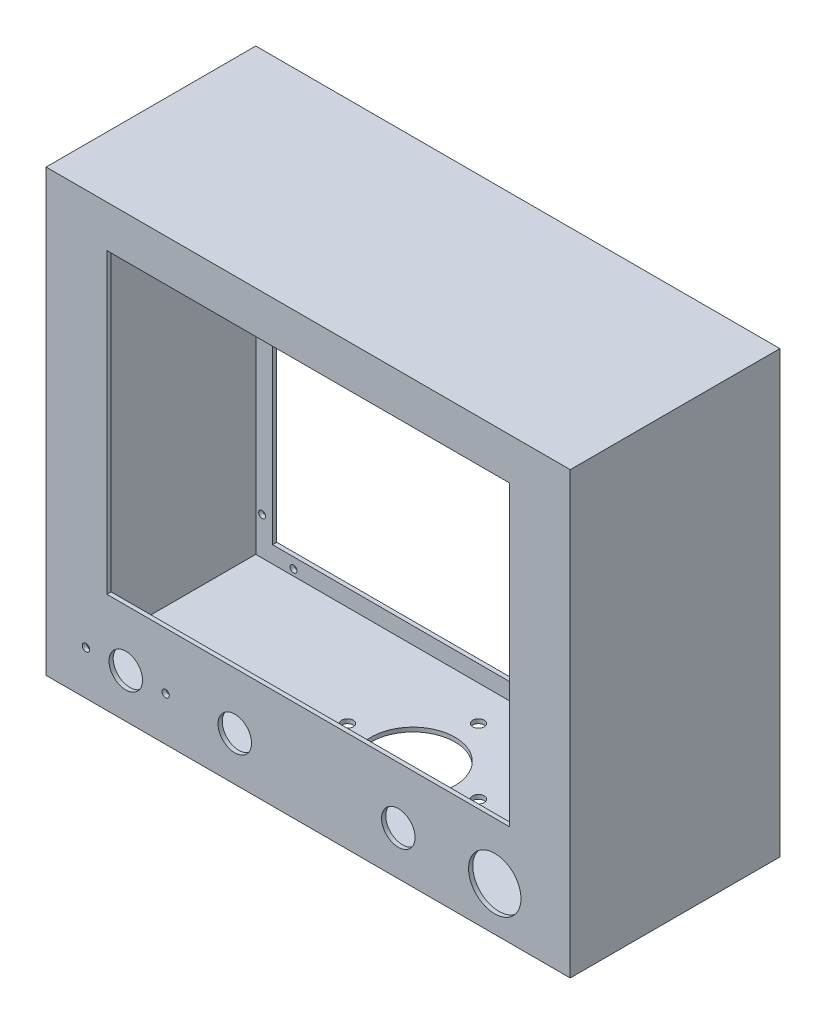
ISO-10303-21;
HEADER;
FILE_DESCRIPTION(('STEP AP214'),'2;1');
FILE_NAME('part.step','',(''),(''),'','','');
FILE_SCHEMA(('AUTOMOTIVE_DESIGN { 1 0 10303 214 1 1 1 1 }'));
ENDSEC;
DATA;
#1=APPLICATION_CONTEXT('core data for automotive mechanical design processes');
#2=APPLICATION_PROTOCOL_DEFINITION('international standard','automotive_design',2000,#1);
#3=PRODUCT_CONTEXT('',#1,'mechanical');
#4=PRODUCT('Part','Part','',(#3));
#5=PRODUCT_RELATED_PRODUCT_CATEGORY('part','',(#4));
#6=PRODUCT_DEFINITION_FORMATION('','',#4);
#7=PRODUCT_DEFINITION_CONTEXT('part definition',#1,'design');
#8=PRODUCT_DEFINITION('design','',#6,#7);
#9=PRODUCT_DEFINITION_SHAPE('','',#8);
#10=(LENGTH_UNIT() NAMED_UNIT(*) SI_UNIT(.MILLI.,.METRE.));
#11=(NAMED_UNIT(*) PLANE_ANGLE_UNIT() SI_UNIT($,.RADIAN.));
#12=(NAMED_UNIT(*) SI_UNIT($,.STERADIAN.) SOLID_ANGLE_UNIT());
#13=UNCERTAINTY_MEASURE_WITH_UNIT(LENGTH_MEASURE(1.E-05),#10,'distance_accuracy_value','');
#14=(GEOMETRIC_REPRESENTATION_CONTEXT(3) GLOBAL_UNCERTAINTY_ASSIGNED_CONTEXT((#13)) GLOBAL_UNIT_ASSIGNED_CONTEXT((#10,
#11,#12)) REPRESENTATION_CONTEXT('',''));
#15=CARTESIAN_POINT('',(0.,0.,0.));
#16=DIRECTION('',(0.,0.,1.));
#17=DIRECTION('',(1.,0.,0.));
#18=AXIS2_PLACEMENT_3D('',#15,#16,#17);
#19=CARTESIAN_POINT('',(0.,0.,100.));
#20=DIRECTION('',(1.,0.,0.));
#21=DIRECTION('',(0.,0.,-1.));
#22=AXIS2_PLACEMENT_3D('',#19,#20,#21);
#23=PLANE('',#22);
#24=DIRECTION('',(0.,-1.,0.));
#25=VECTOR('',#24,1.);
#26=CARTESIAN_POINT('',(0.,0.,0.));
#27=LINE('',#26,#25);
#28=CARTESIAN_POINT('',(0.,210.000000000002,0.));
#29=VERTEX_POINT('',#28);
#30=CARTESIAN_POINT('',(0.,0.,0.));
#31=VERTEX_POINT('',#30);
#32=EDGE_CURVE('E248',#29,#31,#27,.T.);
#33=ORIENTED_EDGE('',*,*,#32,.T.);
#34=DIRECTION('',(0.,0.,-1.));
#35=VECTOR('',#34,1.);
#36=CARTESIAN_POINT('',(0.,0.,100.));
#37=LINE('',#36,#35);
#38=CARTESIAN_POINT('',(0.,0.,100.));
#39=VERTEX_POINT('',#38);
#40=EDGE_CURVE('E281',#39,#31,#37,.T.);
#41=ORIENTED_EDGE('',*,*,#40,.F.);
#42=DIRECTION('',(0.,-1.,0.));
#43=VECTOR('',#42,1.);
#44=CARTESIAN_POINT('',(0.,0.,100.));
#45=LINE('',#44,#43);
#46=CARTESIAN_POINT('',(0.,210.000000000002,100.));
#47=VERTEX_POINT('',#46);
#48=EDGE_CURVE('E255',#47,#39,#45,.T.);
#49=ORIENTED_EDGE('',*,*,#48,.F.);
#50=DIRECTION('',(0.,0.,-1.));
#51=VECTOR('',#50,1.);
#52=CARTESIAN_POINT('',(0.,210.000000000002,100.));
#53=LINE('',#52,#51);
#54=EDGE_CURVE('E265',#47,#29,#53,.T.);
#55=ORIENTED_EDGE('',*,*,#54,.T.);
#56=EDGE_LOOP('',(#33,#41,#49,#55));
#57=FACE_BOUND('',#56,.T.);
#58=ADVANCED_FACE('F32',(#57),#23,.F.);
#59=CARTESIAN_POINT('',(0.,0.,100.));
#60=DIRECTION('',(0.,1.,0.));
#61=DIRECTION('',(0.,0.,1.));
#62=AXIS2_PLACEMENT_3D('',#59,#60,#61);
#63=PLANE('',#62);
#64=CARTESIAN_POINT('',(93.7500000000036,0.,50.));
#65=DIRECTION('',(0.,1.,0.));
#66=DIRECTION('',(0.,0.,1.));
#67=AXIS2_PLACEMENT_3D('',#64,#65,#66);
#68=CIRCLE('',#67,2.75);
#69=CARTESIAN_POINT('',(93.7500000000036,0.,52.75));
#70=VERTEX_POINT('',#69);
#71=EDGE_CURVE('E766',#70,#70,#68,.T.);
#72=ORIENTED_EDGE('',*,*,#71,.T.);
#73=EDGE_LOOP('',(#72));
#74=FACE_BOUND('',#73,.T.);
#75=CARTESIAN_POINT('',(125.000000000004,0.,18.75));
#76=DIRECTION('',(0.,1.,0.));
#77=DIRECTION('',(0.,0.,1.));
#78=AXIS2_PLACEMENT_3D('',#75,#76,#77);
#79=CIRCLE('',#78,2.75);
#80=CARTESIAN_POINT('',(125.000000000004,0.,21.5));
#81=VERTEX_POINT('',#80);
#82=EDGE_CURVE('E770',#81,#81,#79,.T.);
#83=ORIENTED_EDGE('',*,*,#82,.T.);
#84=EDGE_LOOP('',(#83));
#85=FACE_BOUND('',#84,.T.);
#86=CARTESIAN_POINT('',(156.250000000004,0.,50.));
#87=DIRECTION('',(0.,1.,0.));
#88=DIRECTION('',(0.,0.,1.));
#89=AXIS2_PLACEMENT_3D('',#86,#87,#88);
#90=CIRCLE('',#89,2.75);
#91=CARTESIAN_POINT('',(156.250000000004,0.,52.75));
#92=VERTEX_POINT('',#91);
#93=EDGE_CURVE('E774',#92,#92,#90,.T.);
#94=ORIENTED_EDGE('',*,*,#93,.T.);
#95=EDGE_LOOP('',(#94));
#96=FACE_BOUND('',#95,.T.);
#97=CARTESIAN_POINT('',(125.000000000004,0.,81.25));
#98=DIRECTION('',(0.,1.,0.));
#99=DIRECTION('',(0.,0.,1.));
#100=AXIS2_PLACEMENT_3D('',#97,#98,#99);
#101=CIRCLE('',#100,2.75);
#102=CARTESIAN_POINT('',(125.000000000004,0.,84.));
#103=VERTEX_POINT('',#102);
#104=EDGE_CURVE('E375',#103,#103,#101,.T.);
#105=ORIENTED_EDGE('',*,*,#104,.T.);
#106=EDGE_LOOP('',(#105));
#107=FACE_BOUND('',#106,.T.);
#108=CARTESIAN_POINT('',(125.000000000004,0.,50.));
#109=DIRECTION('',(0.,1.,0.));
#110=DIRECTION('',(0.,0.,1.));
#111=AXIS2_PLACEMENT_3D('',#108,#109,#110);
#112=CIRCLE('',#111,20.);
#113=CARTESIAN_POINT('',(125.000000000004,0.,70.));
#114=VERTEX_POINT('',#113);
#115=EDGE_CURVE('E374',#114,#114,#112,.T.);
#116=ORIENTED_EDGE('',*,*,#115,.T.);
#117=EDGE_LOOP('',(#116));
#118=FACE_BOUND('',#117,.T.);
#119=DIRECTION('',(1.,0.,0.));
#120=VECTOR('',#119,1.);
#121=CARTESIAN_POINT('',(0.,0.,0.));
#122=LINE('',#121,#120);
#123=CARTESIAN_POINT('',(250.000000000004,0.,0.));
#124=VERTEX_POINT('',#123);
#125=EDGE_CURVE('E268',#31,#124,#122,.T.);
#126=ORIENTED_EDGE('',*,*,#125,.T.);
#127=DIRECTION('',(0.,0.,-1.));
#128=VECTOR('',#127,1.);
#129=CARTESIAN_POINT('',(250.000000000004,0.,100.));
#130=LINE('',#129,#128);
#131=CARTESIAN_POINT('',(250.000000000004,0.,100.));
#132=VERTEX_POINT('',#131);
#133=EDGE_CURVE('E278',#132,#124,#130,.T.);
#134=ORIENTED_EDGE('',*,*,#133,.F.);
#135=DIRECTION('',(1.,0.,0.));
#136=VECTOR('',#135,1.);
#137=CARTESIAN_POINT('',(0.,0.,100.));
#138=LINE('',#137,#136);
#139=EDGE_CURVE('E258',#39,#132,#138,.T.);
#140=ORIENTED_EDGE('',*,*,#139,.F.);
#141=ORIENTED_EDGE('',*,*,#40,.T.);
#142=EDGE_LOOP('',(#126,#134,#140,#141));
#143=FACE_BOUND('',#142,.T.);
#144=ADVANCED_FACE('F336',(#74,#85,#96,#107,#118,#143),#63,.F.);
#145=CARTESIAN_POINT('',(250.000000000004,0.,100.));
#146=DIRECTION('',(-1.,0.,0.));
#147=DIRECTION('',(0.,0.,1.));
#148=AXIS2_PLACEMENT_3D('',#145,#146,#147);
#149=PLANE('',#148);
#150=DIRECTION('',(0.,1.,0.));
#151=VECTOR('',#150,1.);
#152=CARTESIAN_POINT('',(250.000000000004,0.,0.));
#153=LINE('',#152,#151);
#154=CARTESIAN_POINT('',(250.000000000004,210.000000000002,0.));
#155=VERTEX_POINT('',#154);
#156=EDGE_CURVE('E270',#124,#155,#153,.T.);
#157=ORIENTED_EDGE('',*,*,#156,.T.);
#158=DIRECTION('',(0.,0.,-1.));
#159=VECTOR('',#158,1.);
#160=CARTESIAN_POINT('',(250.000000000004,210.000000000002,100.));
#161=LINE('',#160,#159);
#162=CARTESIAN_POINT('',(250.000000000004,210.000000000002,100.));
#163=VERTEX_POINT('',#162);
#164=EDGE_CURVE('E275',#163,#155,#161,.T.);
#165=ORIENTED_EDGE('',*,*,#164,.F.);
#166=DIRECTION('',(0.,1.,0.));
#167=VECTOR('',#166,1.);
#168=CARTESIAN_POINT('',(250.000000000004,0.,100.));
#169=LINE('',#168,#167);
#170=EDGE_CURVE('E261',#132,#163,#169,.T.);
#171=ORIENTED_EDGE('',*,*,#170,.F.);
#172=ORIENTED_EDGE('',*,*,#133,.T.);
#173=EDGE_LOOP('',(#157,#165,#171,#172));
#174=FACE_BOUND('',#173,.T.);
#175=ADVANCED_FACE('F342',(#174),#149,.F.);
#176=CARTESIAN_POINT('',(0.,210.000000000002,100.));
#177=DIRECTION('',(0.,-1.,0.));
#178=DIRECTION('',(0.,0.,-1.));
#179=AXIS2_PLACEMENT_3D('',#176,#177,#178);
#180=PLANE('',#179);
#181=DIRECTION('',(-1.,0.,0.));
#182=VECTOR('',#181,1.);
#183=CARTESIAN_POINT('',(0.,210.000000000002,0.));
#184=LINE('',#183,#182);
#185=EDGE_CURVE('E259',#155,#29,#184,.T.);
#186=ORIENTED_EDGE('',*,*,#185,.T.);
#187=ORIENTED_EDGE('',*,*,#54,.F.);
#188=DIRECTION('',(-1.,0.,0.));
#189=VECTOR('',#188,1.);
#190=CARTESIAN_POINT('',(0.,210.000000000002,100.));
#191=LINE('',#190,#189);
#192=EDGE_CURVE('E263',#163,#47,#191,.T.);
#193=ORIENTED_EDGE('',*,*,#192,.F.);
#194=ORIENTED_EDGE('',*,*,#164,.T.);
#195=EDGE_LOOP('',(#186,#187,#193,#194));
#196=FACE_BOUND('',#195,.T.);
#197=ADVANCED_FACE('F495',(#196),#180,.F.);
#198=CARTESIAN_POINT('',(0.,210.000000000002,100.));
#199=DIRECTION('',(0.,0.,-1.));
#200=DIRECTION('',(-1.,0.,0.));
#201=AXIS2_PLACEMENT_3D('',#198,#199,#200);
#202=PLANE('',#201);
#203=CARTESIAN_POINT('',(214.,21.0000000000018,100.));
#204=DIRECTION('',(0.,0.,1.));
#205=DIRECTION('',(1.,0.,0.));
#206=AXIS2_PLACEMENT_3D('',#203,#204,#205);
#207=CIRCLE('',#206,12.5);
#208=CARTESIAN_POINT('',(226.5,21.0000000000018,100.));
#209=VERTEX_POINT('',#208);
#210=EDGE_CURVE('E183',#209,#209,#207,.T.);
#211=ORIENTED_EDGE('',*,*,#210,.F.);
#212=EDGE_LOOP('',(#211));
#213=FACE_BOUND('',#212,.T.);
#214=CARTESIAN_POINT('',(38.0000000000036,21.0000000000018,100.));
#215=DIRECTION('',(0.,0.,1.));
#216=DIRECTION('',(1.,0.,0.));
#217=AXIS2_PLACEMENT_3D('',#214,#215,#216);
#218=CIRCLE('',#217,8.);
#219=CARTESIAN_POINT('',(46.0000000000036,21.0000000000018,100.));
#220=VERTEX_POINT('',#219);
#221=EDGE_CURVE('E190',#220,#220,#218,.T.);
#222=ORIENTED_EDGE('',*,*,#221,.F.);
#223=EDGE_LOOP('',(#222));
#224=FACE_BOUND('',#223,.T.);
#225=CARTESIAN_POINT('',(168.000000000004,21.0000000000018,100.));
#226=DIRECTION('',(0.,0.,1.));
#227=DIRECTION('',(1.,0.,0.));
#228=AXIS2_PLACEMENT_3D('',#225,#226,#227);
#229=CIRCLE('',#228,8.00000000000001);
#230=CARTESIAN_POINT('',(176.000000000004,21.0000000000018,100.));
#231=VERTEX_POINT('',#230);
#232=EDGE_CURVE('E196',#231,#231,#229,.T.);
#233=ORIENTED_EDGE('',*,*,#232,.F.);
#234=EDGE_LOOP('',(#233));
#235=FACE_BOUND('',#234,.T.);
#236=CARTESIAN_POINT('',(90.,21.0000000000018,100.));
#237=DIRECTION('',(0.,0.,1.));
#238=DIRECTION('',(1.,0.,0.));
#239=AXIS2_PLACEMENT_3D('',#236,#237,#238);
#240=CIRCLE('',#239,8.00000000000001);
#241=CARTESIAN_POINT('',(98.,21.0000000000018,100.));
#242=VERTEX_POINT('',#241);
#243=EDGE_CURVE('E202',#242,#242,#240,.T.);
#244=ORIENTED_EDGE('',*,*,#243,.F.);
#245=EDGE_LOOP('',(#244));
#246=FACE_BOUND('',#245,.T.);
#247=CARTESIAN_POINT('',(57.0000000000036,21.0000000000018,100.));
#248=DIRECTION('',(0.,0.,1.));
#249=DIRECTION('',(1.,0.,0.));
#250=AXIS2_PLACEMENT_3D('',#247,#248,#249);
#251=CIRCLE('',#250,1.75);
#252=CARTESIAN_POINT('',(58.7500000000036,21.0000000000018,100.));
#253=VERTEX_POINT('',#252);
#254=EDGE_CURVE('E208',#253,#253,#251,.T.);
#255=ORIENTED_EDGE('',*,*,#254,.F.);
#256=EDGE_LOOP('',(#255));
#257=FACE_BOUND('',#256,.T.);
#258=CARTESIAN_POINT('',(19.0000000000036,21.0000000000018,100.));
#259=DIRECTION('',(0.,0.,1.));
#260=DIRECTION('',(1.,0.,0.));
#261=AXIS2_PLACEMENT_3D('',#258,#259,#260);
#262=CIRCLE('',#261,1.75);
#263=CARTESIAN_POINT('',(20.7500000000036,21.0000000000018,100.));
#264=VERTEX_POINT('',#263);
#265=EDGE_CURVE('E214',#264,#264,#262,.T.);
#266=ORIENTED_EDGE('',*,*,#265,.F.);
#267=EDGE_LOOP('',(#266));
#268=FACE_BOUND('',#267,.T.);
#269=DIRECTION('',(1.,0.,0.));
#270=VECTOR('',#269,1.);
#271=CARTESIAN_POINT('',(29.,48.,100.));
#272=LINE('',#271,#270);
#273=CARTESIAN_POINT('',(29.,48.,100.));
#274=VERTEX_POINT('',#273);
#275=CARTESIAN_POINT('',(221.,48.,100.));
#276=VERTEX_POINT('',#275);
#277=EDGE_CURVE('E238',#274,#276,#272,.T.);
#278=ORIENTED_EDGE('',*,*,#277,.F.);
#279=DIRECTION('',(0.,-1.,0.));
#280=VECTOR('',#279,1.);
#281=CARTESIAN_POINT('',(29.,48.,100.));
#282=LINE('',#281,#280);
#283=CARTESIAN_POINT('',(29.,190.000000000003,100.));
#284=VERTEX_POINT('',#283);
#285=EDGE_CURVE('E220',#284,#274,#282,.T.);
#286=ORIENTED_EDGE('',*,*,#285,.F.);
#287=DIRECTION('',(-1.,0.,0.));
#288=VECTOR('',#287,1.);
#289=CARTESIAN_POINT('',(29.,190.000000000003,100.));
#290=LINE('',#289,#288);
#291=CARTESIAN_POINT('',(221.,190.000000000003,100.));
#292=VERTEX_POINT('',#291);
#293=EDGE_CURVE('E227',#292,#284,#290,.T.);
#294=ORIENTED_EDGE('',*,*,#293,.F.);
#295=DIRECTION('',(0.,1.,0.));
#296=VECTOR('',#295,1.);
#297=CARTESIAN_POINT('',(221.,48.,100.));
#298=LINE('',#297,#296);
#299=EDGE_CURVE('E241',#276,#292,#298,.T.);
#300=ORIENTED_EDGE('',*,*,#299,.F.);
#301=EDGE_LOOP('',(#278,#286,#294,#300));
#302=FACE_BOUND('',#301,.T.);
#303=ORIENTED_EDGE('',*,*,#48,.T.);
#304=ORIENTED_EDGE('',*,*,#139,.T.);
#305=ORIENTED_EDGE('',*,*,#170,.T.);
#306=ORIENTED_EDGE('',*,*,#192,.T.);
#307=EDGE_LOOP('',(#303,#304,#305,#306));
#308=FACE_BOUND('',#307,.T.);
#309=ADVANCED_FACE('F492',(#213,#224,#235,#246,#257,#268,#302,#308),#202,.F.);
#310=CARTESIAN_POINT('',(0.,210.000000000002,0.));
#311=DIRECTION('',(0.,0.,-1.));
#312=DIRECTION('',(-1.,0.,0.));
#313=AXIS2_PLACEMENT_3D('',#310,#311,#312);
#314=PLANE('',#313);
#315=CARTESIAN_POINT('',(5.,190.000000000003,0.));
#316=DIRECTION('',(0.,0.,1.));
#317=DIRECTION('',(1.,0.,0.));
#318=AXIS2_PLACEMENT_3D('',#315,#316,#317);
#319=CIRCLE('',#318,1.65);
#320=CARTESIAN_POINT('',(6.65,190.000000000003,0.));
#321=VERTEX_POINT('',#320);
#322=EDGE_CURVE('E384',#321,#321,#319,.T.);
#323=ORIENTED_EDGE('',*,*,#322,.T.);
#324=EDGE_LOOP('',(#323));
#325=FACE_BOUND('',#324,.T.);
#326=CARTESIAN_POINT('',(5.,20.0000000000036,0.));
#327=DIRECTION('',(0.,0.,1.));
#328=DIRECTION('',(1.,0.,0.));
#329=AXIS2_PLACEMENT_3D('',#326,#327,#328);
#330=CIRCLE('',#329,1.65);
#331=CARTESIAN_POINT('',(6.65,20.0000000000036,0.));
#332=VERTEX_POINT('',#331);
#333=EDGE_CURVE('E390',#332,#332,#330,.T.);
#334=ORIENTED_EDGE('',*,*,#333,.T.);
#335=EDGE_LOOP('',(#334));
#336=FACE_BOUND('',#335,.T.);
#337=CARTESIAN_POINT('',(20.,5.00000000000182,0.));
#338=DIRECTION('',(0.,0.,1.));
#339=DIRECTION('',(1.,0.,0.));
#340=AXIS2_PLACEMENT_3D('',#337,#338,#339);
#341=CIRCLE('',#340,1.65);
#342=CARTESIAN_POINT('',(21.65,5.00000000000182,0.));
#343=VERTEX_POINT('',#342);
#344=EDGE_CURVE('E396',#343,#343,#341,.T.);
#345=ORIENTED_EDGE('',*,*,#344,.T.);
#346=EDGE_LOOP('',(#345));
#347=FACE_BOUND('',#346,.T.);
#348=CARTESIAN_POINT('',(230.000000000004,5.00000000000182,0.));
#349=DIRECTION('',(0.,0.,1.));
#350=DIRECTION('',(1.,0.,0.));
#351=AXIS2_PLACEMENT_3D('',#348,#349,#350);
#352=CIRCLE('',#351,1.65000000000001);
#353=CARTESIAN_POINT('',(231.650000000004,5.00000000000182,0.));
#354=VERTEX_POINT('',#353);
#355=EDGE_CURVE('E402',#354,#354,#352,.T.);
#356=ORIENTED_EDGE('',*,*,#355,.T.);
#357=EDGE_LOOP('',(#356));
#358=FACE_BOUND('',#357,.T.);
#359=CARTESIAN_POINT('',(245.000000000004,20.0000000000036,0.));
#360=DIRECTION('',(0.,0.,1.));
#361=DIRECTION('',(1.,0.,0.));
#362=AXIS2_PLACEMENT_3D('',#359,#360,#361);
#363=CIRCLE('',#362,1.65000000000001);
#364=CARTESIAN_POINT('',(246.650000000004,20.0000000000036,0.));
#365=VERTEX_POINT('',#364);
#366=EDGE_CURVE('E408',#365,#365,#363,.T.);
#367=ORIENTED_EDGE('',*,*,#366,.T.);
#368=EDGE_LOOP('',(#367));
#369=FACE_BOUND('',#368,.T.);
#370=CARTESIAN_POINT('',(245.000000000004,190.000000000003,0.));
#371=DIRECTION('',(0.,0.,1.));
#372=DIRECTION('',(1.,0.,0.));
#373=AXIS2_PLACEMENT_3D('',#370,#371,#372);
#374=CIRCLE('',#373,1.65000000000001);
#375=CARTESIAN_POINT('',(246.650000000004,190.000000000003,0.));
#376=VERTEX_POINT('',#375);
#377=EDGE_CURVE('E414',#376,#376,#374,.T.);
#378=ORIENTED_EDGE('',*,*,#377,.T.);
#379=EDGE_LOOP('',(#378));
#380=FACE_BOUND('',#379,.T.);
#381=CARTESIAN_POINT('',(230.000000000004,205.000000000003,0.));
#382=DIRECTION('',(0.,0.,1.));
#383=DIRECTION('',(1.,0.,0.));
#384=AXIS2_PLACEMENT_3D('',#381,#382,#383);
#385=CIRCLE('',#384,1.65000000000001);
#386=CARTESIAN_POINT('',(231.650000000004,205.000000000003,0.));
#387=VERTEX_POINT('',#386);
#388=EDGE_CURVE('E420',#387,#387,#385,.T.);
#389=ORIENTED_EDGE('',*,*,#388,.T.);
#390=EDGE_LOOP('',(#389));
#391=FACE_BOUND('',#390,.T.);
#392=CARTESIAN_POINT('',(20.,205.000000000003,0.));
#393=DIRECTION('',(0.,0.,1.));
#394=DIRECTION('',(1.,0.,0.));
#395=AXIS2_PLACEMENT_3D('',#392,#393,#394);
#396=CIRCLE('',#395,1.65);
#397=CARTESIAN_POINT('',(21.65,205.000000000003,0.));
#398=VERTEX_POINT('',#397);
#399=EDGE_CURVE('E177',#398,#398,#396,.T.);
#400=ORIENTED_EDGE('',*,*,#399,.T.);
#401=EDGE_LOOP('',(#400));
#402=FACE_BOUND('',#401,.T.);
#403=DIRECTION('',(1.,0.,0.));
#404=VECTOR('',#403,1.);
#405=CARTESIAN_POINT('',(10.0000000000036,10.0000000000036,0.));
#406=LINE('',#405,#404);
#407=CARTESIAN_POINT('',(10.0000000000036,10.0000000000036,0.));
#408=VERTEX_POINT('',#407);
#409=CARTESIAN_POINT('',(240.000000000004,10.0000000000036,0.));
#410=VERTEX_POINT('',#409);
#411=EDGE_CURVE('E148',#408,#410,#406,.T.);
#412=ORIENTED_EDGE('',*,*,#411,.T.);
#413=DIRECTION('',(0.,1.,0.));
#414=VECTOR('',#413,1.);
#415=CARTESIAN_POINT('',(240.000000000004,10.0000000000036,0.));
#416=LINE('',#415,#414);
#417=CARTESIAN_POINT('',(240.000000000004,200.000000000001,0.));
#418=VERTEX_POINT('',#417);
#419=EDGE_CURVE('E157',#410,#418,#416,.T.);
#420=ORIENTED_EDGE('',*,*,#419,.T.);
#421=DIRECTION('',(-1.,0.,0.));
#422=VECTOR('',#421,1.);
#423=CARTESIAN_POINT('',(10.0000000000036,200.000000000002,0.));
#424=LINE('',#423,#422);
#425=CARTESIAN_POINT('',(10.0000000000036,200.000000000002,0.));
#426=VERTEX_POINT('',#425);
#427=EDGE_CURVE('E49',#418,#426,#424,.T.);
#428=ORIENTED_EDGE('',*,*,#427,.T.);
#429=DIRECTION('',(0.,-1.,0.));
#430=VECTOR('',#429,1.);
#431=CARTESIAN_POINT('',(10.0000000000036,10.0000000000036,0.));
#432=LINE('',#431,#430);
#433=EDGE_CURVE('E154',#426,#408,#432,.T.);
#434=ORIENTED_EDGE('',*,*,#433,.T.);
#435=EDGE_LOOP('',(#412,#420,#428,#434));
#436=FACE_BOUND('',#435,.T.);
#437=ORIENTED_EDGE('',*,*,#32,.F.);
#438=ORIENTED_EDGE('',*,*,#185,.F.);
#439=ORIENTED_EDGE('',*,*,#156,.F.);
#440=ORIENTED_EDGE('',*,*,#125,.F.);
#441=EDGE_LOOP('',(#437,#438,#439,#440));
#442=FACE_BOUND('',#441,.T.);
#443=ADVANCED_FACE('F161',(#325,#336,#347,#358,#369,#380,#391,#402,#436,#442),#314,.T.);
#444=CARTESIAN_POINT('',(29.,48.,98.));
#445=DIRECTION('',(-1.,0.,0.));
#446=DIRECTION('',(0.,0.,1.));
#447=AXIS2_PLACEMENT_3D('',#444,#445,#446);
#448=PLANE('',#447);
#449=ORIENTED_EDGE('',*,*,#285,.T.);
#450=DIRECTION('',(0.,0.,1.));
#451=VECTOR('',#450,1.);
#452=CARTESIAN_POINT('',(29.,48.,98.));
#453=LINE('',#452,#451);
#454=CARTESIAN_POINT('',(29.,48.,98.));
#455=VERTEX_POINT('',#454);
#456=EDGE_CURVE('E236',#455,#274,#453,.T.);
#457=ORIENTED_EDGE('',*,*,#456,.F.);
#458=DIRECTION('',(0.,-1.,0.));
#459=VECTOR('',#458,1.);
#460=CARTESIAN_POINT('',(29.,48.,98.));
#461=LINE('',#460,#459);
#462=CARTESIAN_POINT('',(29.,190.000000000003,98.));
#463=VERTEX_POINT('',#462);
#464=EDGE_CURVE('E223',#463,#455,#461,.T.);
#465=ORIENTED_EDGE('',*,*,#464,.F.);
#466=DIRECTION('',(0.,0.,1.));
#467=VECTOR('',#466,1.);
#468=CARTESIAN_POINT('',(29.,190.000000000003,98.));
#469=LINE('',#468,#467);
#470=EDGE_CURVE('E246',#463,#284,#469,.T.);
#471=ORIENTED_EDGE('',*,*,#470,.T.);
#472=EDGE_LOOP('',(#449,#457,#465,#471));
#473=FACE_BOUND('',#472,.T.);
#474=ADVANCED_FACE('F481',(#473),#448,.F.);
#475=CARTESIAN_POINT('',(29.,190.000000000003,98.));
#476=DIRECTION('',(0.,1.,0.));
#477=DIRECTION('',(0.,0.,1.));
#478=AXIS2_PLACEMENT_3D('',#475,#476,#477);
#479=PLANE('',#478);
#480=ORIENTED_EDGE('',*,*,#293,.T.);
#481=ORIENTED_EDGE('',*,*,#470,.F.);
#482=DIRECTION('',(-1.,0.,0.));
#483=VECTOR('',#482,1.);
#484=CARTESIAN_POINT('',(29.,190.000000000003,98.));
#485=LINE('',#484,#483);
#486=CARTESIAN_POINT('',(221.,190.000000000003,98.));
#487=VERTEX_POINT('',#486);
#488=EDGE_CURVE('E233',#487,#463,#485,.T.);
#489=ORIENTED_EDGE('',*,*,#488,.F.);
#490=DIRECTION('',(0.,0.,1.));
#491=VECTOR('',#490,1.);
#492=CARTESIAN_POINT('',(221.,190.000000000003,98.));
#493=LINE('',#492,#491);
#494=EDGE_CURVE('E249',#487,#292,#493,.T.);
#495=ORIENTED_EDGE('',*,*,#494,.T.);
#496=EDGE_LOOP('',(#480,#481,#489,#495));
#497=FACE_BOUND('',#496,.T.);
#498=ADVANCED_FACE('F477',(#497),#479,.F.);
#499=CARTESIAN_POINT('',(221.,48.,98.));
#500=DIRECTION('',(1.,0.,0.));
#501=DIRECTION('',(0.,0.,-1.));
#502=AXIS2_PLACEMENT_3D('',#499,#500,#501);
#503=PLANE('',#502);
#504=ORIENTED_EDGE('',*,*,#299,.T.);
#505=ORIENTED_EDGE('',*,*,#494,.F.);
#506=DIRECTION('',(0.,1.,0.));
#507=VECTOR('',#506,1.);
#508=CARTESIAN_POINT('',(221.,48.,98.));
#509=LINE('',#508,#507);
#510=CARTESIAN_POINT('',(221.,48.,98.));
#511=VERTEX_POINT('',#510);
#512=EDGE_CURVE('E230',#511,#487,#509,.T.);
#513=ORIENTED_EDGE('',*,*,#512,.F.);
#514=DIRECTION('',(0.,0.,1.));
#515=VECTOR('',#514,1.);
#516=CARTESIAN_POINT('',(221.,48.,98.));
#517=LINE('',#516,#515);
#518=EDGE_CURVE('E251',#511,#276,#517,.T.);
#519=ORIENTED_EDGE('',*,*,#518,.T.);
#520=EDGE_LOOP('',(#504,#505,#513,#519));
#521=FACE_BOUND('',#520,.T.);
#522=ADVANCED_FACE('F480',(#521),#503,.F.);
#523=CARTESIAN_POINT('',(29.,48.,98.));
#524=DIRECTION('',(0.,-1.,0.));
#525=DIRECTION('',(0.,0.,-1.));
#526=AXIS2_PLACEMENT_3D('',#523,#524,#525);
#527=PLANE('',#526);
#528=ORIENTED_EDGE('',*,*,#277,.T.);
#529=ORIENTED_EDGE('',*,*,#518,.F.);
#530=DIRECTION('',(1.,0.,0.));
#531=VECTOR('',#530,1.);
#532=CARTESIAN_POINT('',(29.,48.,98.));
#533=LINE('',#532,#531);
#534=EDGE_CURVE('E226',#455,#511,#533,.T.);
#535=ORIENTED_EDGE('',*,*,#534,.F.);
#536=ORIENTED_EDGE('',*,*,#456,.T.);
#537=EDGE_LOOP('',(#528,#529,#535,#536));
#538=FACE_BOUND('',#537,.T.);
#539=ADVANCED_FACE('F349',(#538),#527,.F.);
#540=CARTESIAN_POINT('',(2.,0.,100.));
#541=DIRECTION('',(1.,0.,0.));
#542=DIRECTION('',(0.,0.,-1.));
#543=AXIS2_PLACEMENT_3D('',#540,#541,#542);
#544=PLANE('',#543);
#545=DIRECTION('',(0.,-1.,0.));
#546=VECTOR('',#545,1.);
#547=CARTESIAN_POINT('',(2.,210.000000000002,2.));
#548=LINE('',#547,#546);
#549=CARTESIAN_POINT('',(2.,208.000000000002,2.));
#550=VERTEX_POINT('',#549);
#551=CARTESIAN_POINT('',(2.,2.,2.));
#552=VERTEX_POINT('',#551);
#553=EDGE_CURVE('E36',#550,#552,#548,.T.);
#554=ORIENTED_EDGE('',*,*,#553,.F.);
#555=DIRECTION('',(0.,0.,-1.));
#556=VECTOR('',#555,1.);
#557=CARTESIAN_POINT('',(2.,208.000000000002,100.));
#558=LINE('',#557,#556);
#559=CARTESIAN_POINT('',(2.,208.000000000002,98.));
#560=VERTEX_POINT('',#559);
#561=EDGE_CURVE('E304',#560,#550,#558,.T.);
#562=ORIENTED_EDGE('',*,*,#561,.F.);
#563=DIRECTION('',(0.,-1.,0.));
#564=VECTOR('',#563,1.);
#565=CARTESIAN_POINT('',(2.,210.000000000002,98.));
#566=LINE('',#565,#564);
#567=CARTESIAN_POINT('',(2.,2.,98.));
#568=VERTEX_POINT('',#567);
#569=EDGE_CURVE('E287',#560,#568,#566,.T.);
#570=ORIENTED_EDGE('',*,*,#569,.T.);
#571=DIRECTION('',(0.,0.,-1.));
#572=VECTOR('',#571,1.);
#573=CARTESIAN_POINT('',(2.,2.,100.));
#574=LINE('',#573,#572);
#575=EDGE_CURVE('E300',#568,#552,#574,.T.);
#576=ORIENTED_EDGE('',*,*,#575,.T.);
#577=EDGE_LOOP('',(#554,#562,#570,#576));
#578=FACE_BOUND('',#577,.T.);
#579=ADVANCED_FACE('F313',(#578),#544,.T.);
#580=CARTESIAN_POINT('',(0.,2.,100.));
#581=DIRECTION('',(0.,1.,0.));
#582=DIRECTION('',(0.,0.,1.));
#583=AXIS2_PLACEMENT_3D('',#580,#581,#582);
#584=PLANE('',#583);
#585=CARTESIAN_POINT('',(93.7500000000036,2.,50.));
#586=DIRECTION('',(0.,1.,0.));
#587=DIRECTION('',(0.,0.,1.));
#588=AXIS2_PLACEMENT_3D('',#585,#586,#587);
#589=CIRCLE('',#588,2.75);
#590=CARTESIAN_POINT('',(93.7500000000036,2.,52.75));
#591=VERTEX_POINT('',#590);
#592=EDGE_CURVE('E357',#591,#591,#589,.T.);
#593=ORIENTED_EDGE('',*,*,#592,.F.);
#594=EDGE_LOOP('',(#593));
#595=FACE_BOUND('',#594,.T.);
#596=CARTESIAN_POINT('',(125.000000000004,2.,18.75));
#597=DIRECTION('',(0.,1.,0.));
#598=DIRECTION('',(0.,0.,1.));
#599=AXIS2_PLACEMENT_3D('',#596,#597,#598);
#600=CIRCLE('',#599,2.75);
#601=CARTESIAN_POINT('',(125.000000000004,2.,21.5));
#602=VERTEX_POINT('',#601);
#603=EDGE_CURVE('E361',#602,#602,#600,.T.);
#604=ORIENTED_EDGE('',*,*,#603,.F.);
#605=EDGE_LOOP('',(#604));
#606=FACE_BOUND('',#605,.T.);
#607=CARTESIAN_POINT('',(156.250000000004,2.,50.));
#608=DIRECTION('',(0.,1.,0.));
#609=DIRECTION('',(0.,0.,1.));
#610=AXIS2_PLACEMENT_3D('',#607,#608,#609);
#611=CIRCLE('',#610,2.75);
#612=CARTESIAN_POINT('',(156.250000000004,2.,52.75));
#613=VERTEX_POINT('',#612);
#614=EDGE_CURVE('E365',#613,#613,#611,.T.);
#615=ORIENTED_EDGE('',*,*,#614,.F.);
#616=EDGE_LOOP('',(#615));
#617=FACE_BOUND('',#616,.T.);
#618=CARTESIAN_POINT('',(125.000000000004,2.,81.25));
#619=DIRECTION('',(0.,1.,0.));
#620=DIRECTION('',(0.,0.,1.));
#621=AXIS2_PLACEMENT_3D('',#618,#619,#620);
#622=CIRCLE('',#621,2.75);
#623=CARTESIAN_POINT('',(125.000000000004,2.,84.));
#624=VERTEX_POINT('',#623);
#625=EDGE_CURVE('E369',#624,#624,#622,.T.);
#626=ORIENTED_EDGE('',*,*,#625,.F.);
#627=EDGE_LOOP('',(#626));
#628=FACE_BOUND('',#627,.T.);
#629=CARTESIAN_POINT('',(125.000000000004,2.,50.));
#630=DIRECTION('',(0.,1.,0.));
#631=DIRECTION('',(0.,0.,1.));
#632=AXIS2_PLACEMENT_3D('',#629,#630,#631);
#633=CIRCLE('',#632,20.);
#634=CARTESIAN_POINT('',(125.000000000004,2.,70.));
#635=VERTEX_POINT('',#634);
#636=EDGE_CURVE('E372',#635,#635,#633,.T.);
#637=ORIENTED_EDGE('',*,*,#636,.F.);
#638=EDGE_LOOP('',(#637));
#639=FACE_BOUND('',#638,.T.);
#640=DIRECTION('',(1.,0.,0.));
#641=VECTOR('',#640,1.);
#642=CARTESIAN_POINT('',(0.,2.,2.));
#643=LINE('',#642,#641);
#644=CARTESIAN_POINT('',(248.000000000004,2.,2.));
#645=VERTEX_POINT('',#644);
#646=EDGE_CURVE('E303',#552,#645,#643,.T.);
#647=ORIENTED_EDGE('',*,*,#646,.F.);
#648=ORIENTED_EDGE('',*,*,#575,.F.);
#649=DIRECTION('',(1.,0.,0.));
#650=VECTOR('',#649,1.);
#651=CARTESIAN_POINT('',(0.,2.,98.));
#652=LINE('',#651,#650);
#653=CARTESIAN_POINT('',(248.000000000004,2.,98.));
#654=VERTEX_POINT('',#653);
#655=EDGE_CURVE('E285',#568,#654,#652,.T.);
#656=ORIENTED_EDGE('',*,*,#655,.T.);
#657=DIRECTION('',(0.,0.,-1.));
#658=VECTOR('',#657,1.);
#659=CARTESIAN_POINT('',(248.000000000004,2.,100.));
#660=LINE('',#659,#658);
#661=EDGE_CURVE('E295',#654,#645,#660,.T.);
#662=ORIENTED_EDGE('',*,*,#661,.T.);
#663=EDGE_LOOP('',(#647,#648,#656,#662));
#664=FACE_BOUND('',#663,.T.);
#665=ADVANCED_FACE('F317',(#595,#606,#617,#628,#639,#664),#584,.T.);
#666=CARTESIAN_POINT('',(248.000000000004,0.,100.));
#667=DIRECTION('',(-1.,0.,0.));
#668=DIRECTION('',(0.,0.,1.));
#669=AXIS2_PLACEMENT_3D('',#666,#667,#668);
#670=PLANE('',#669);
#671=DIRECTION('',(0.,1.,0.));
#672=VECTOR('',#671,1.);
#673=CARTESIAN_POINT('',(248.000000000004,210.000000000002,2.));
#674=LINE('',#673,#672);
#675=CARTESIAN_POINT('',(248.000000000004,208.000000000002,2.));
#676=VERTEX_POINT('',#675);
#677=EDGE_CURVE('E298',#645,#676,#674,.T.);
#678=ORIENTED_EDGE('',*,*,#677,.F.);
#679=ORIENTED_EDGE('',*,*,#661,.F.);
#680=DIRECTION('',(0.,1.,0.));
#681=VECTOR('',#680,1.);
#682=CARTESIAN_POINT('',(248.000000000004,210.000000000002,98.));
#683=LINE('',#682,#681);
#684=CARTESIAN_POINT('',(248.000000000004,208.000000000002,98.));
#685=VERTEX_POINT('',#684);
#686=EDGE_CURVE('E41',#654,#685,#683,.T.);
#687=ORIENTED_EDGE('',*,*,#686,.T.);
#688=DIRECTION('',(0.,0.,-1.));
#689=VECTOR('',#688,1.);
#690=CARTESIAN_POINT('',(248.000000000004,208.000000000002,100.));
#691=LINE('',#690,#689);
#692=EDGE_CURVE('E290',#685,#676,#691,.T.);
#693=ORIENTED_EDGE('',*,*,#692,.T.);
#694=EDGE_LOOP('',(#678,#679,#687,#693));
#695=FACE_BOUND('',#694,.T.);
#696=ADVANCED_FACE('F322',(#695),#670,.T.);
#697=CARTESIAN_POINT('',(0.,208.000000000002,100.));
#698=DIRECTION('',(0.,-1.,0.));
#699=DIRECTION('',(0.,0.,-1.));
#700=AXIS2_PLACEMENT_3D('',#697,#698,#699);
#701=PLANE('',#700);
#702=DIRECTION('',(-1.,0.,0.));
#703=VECTOR('',#702,1.);
#704=CARTESIAN_POINT('',(0.,208.000000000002,2.));
#705=LINE('',#704,#703);
#706=EDGE_CURVE('E293',#676,#550,#705,.T.);
#707=ORIENTED_EDGE('',*,*,#706,.F.);
#708=ORIENTED_EDGE('',*,*,#692,.F.);
#709=DIRECTION('',(-1.,0.,0.));
#710=VECTOR('',#709,1.);
#711=CARTESIAN_POINT('',(0.,208.000000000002,98.));
#712=LINE('',#711,#710);
#713=EDGE_CURVE('E11',#685,#560,#712,.T.);
#714=ORIENTED_EDGE('',*,*,#713,.T.);
#715=ORIENTED_EDGE('',*,*,#561,.T.);
#716=EDGE_LOOP('',(#707,#708,#714,#715));
#717=FACE_BOUND('',#716,.T.);
#718=ADVANCED_FACE('F325',(#717),#701,.T.);
#719=CARTESIAN_POINT('',(0.,210.000000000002,98.));
#720=DIRECTION('',(0.,0.,-1.));
#721=DIRECTION('',(-1.,0.,0.));
#722=AXIS2_PLACEMENT_3D('',#719,#720,#721);
#723=PLANE('',#722);
#724=CARTESIAN_POINT('',(214.,21.0000000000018,98.));
#725=DIRECTION('',(0.,0.,1.));
#726=DIRECTION('',(1.,0.,0.));
#727=AXIS2_PLACEMENT_3D('',#724,#725,#726);
#728=CIRCLE('',#727,12.5);
#729=CARTESIAN_POINT('',(226.5,21.0000000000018,98.));
#730=VERTEX_POINT('',#729);
#731=EDGE_CURVE('E187',#730,#730,#728,.T.);
#732=ORIENTED_EDGE('',*,*,#731,.T.);
#733=EDGE_LOOP('',(#732));
#734=FACE_BOUND('',#733,.T.);
#735=CARTESIAN_POINT('',(38.0000000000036,21.0000000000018,98.));
#736=DIRECTION('',(0.,0.,1.));
#737=DIRECTION('',(1.,0.,0.));
#738=AXIS2_PLACEMENT_3D('',#735,#736,#737);
#739=CIRCLE('',#738,8.);
#740=CARTESIAN_POINT('',(46.0000000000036,21.0000000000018,98.));
#741=VERTEX_POINT('',#740);
#742=EDGE_CURVE('E193',#741,#741,#739,.T.);
#743=ORIENTED_EDGE('',*,*,#742,.T.);
#744=EDGE_LOOP('',(#743));
#745=FACE_BOUND('',#744,.T.);
#746=CARTESIAN_POINT('',(168.000000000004,21.0000000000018,98.));
#747=DIRECTION('',(0.,0.,1.));
#748=DIRECTION('',(1.,0.,0.));
#749=AXIS2_PLACEMENT_3D('',#746,#747,#748);
#750=CIRCLE('',#749,8.00000000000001);
#751=CARTESIAN_POINT('',(176.000000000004,21.0000000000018,98.));
#752=VERTEX_POINT('',#751);
#753=EDGE_CURVE('E199',#752,#752,#750,.T.);
#754=ORIENTED_EDGE('',*,*,#753,.T.);
#755=EDGE_LOOP('',(#754));
#756=FACE_BOUND('',#755,.T.);
#757=CARTESIAN_POINT('',(90.,21.0000000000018,98.));
#758=DIRECTION('',(0.,0.,1.));
#759=DIRECTION('',(1.,0.,0.));
#760=AXIS2_PLACEMENT_3D('',#757,#758,#759);
#761=CIRCLE('',#760,8.00000000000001);
#762=CARTESIAN_POINT('',(98.,21.0000000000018,98.));
#763=VERTEX_POINT('',#762);
#764=EDGE_CURVE('E205',#763,#763,#761,.T.);
#765=ORIENTED_EDGE('',*,*,#764,.T.);
#766=EDGE_LOOP('',(#765));
#767=FACE_BOUND('',#766,.T.);
#768=CARTESIAN_POINT('',(57.0000000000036,21.0000000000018,98.));
#769=DIRECTION('',(0.,0.,1.));
#770=DIRECTION('',(1.,0.,0.));
#771=AXIS2_PLACEMENT_3D('',#768,#769,#770);
#772=CIRCLE('',#771,1.75);
#773=CARTESIAN_POINT('',(58.7500000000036,21.0000000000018,98.));
#774=VERTEX_POINT('',#773);
#775=EDGE_CURVE('E211',#774,#774,#772,.T.);
#776=ORIENTED_EDGE('',*,*,#775,.T.);
#777=EDGE_LOOP('',(#776));
#778=FACE_BOUND('',#777,.T.);
#779=CARTESIAN_POINT('',(19.0000000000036,21.0000000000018,98.));
#780=DIRECTION('',(0.,0.,1.));
#781=DIRECTION('',(1.,0.,0.));
#782=AXIS2_PLACEMENT_3D('',#779,#780,#781);
#783=CIRCLE('',#782,1.75);
#784=CARTESIAN_POINT('',(20.7500000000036,21.0000000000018,98.));
#785=VERTEX_POINT('',#784);
#786=EDGE_CURVE('E217',#785,#785,#783,.T.);
#787=ORIENTED_EDGE('',*,*,#786,.T.);
#788=EDGE_LOOP('',(#787));
#789=FACE_BOUND('',#788,.T.);
#790=ORIENTED_EDGE('',*,*,#464,.T.);
#791=ORIENTED_EDGE('',*,*,#534,.T.);
#792=ORIENTED_EDGE('',*,*,#512,.T.);
#793=ORIENTED_EDGE('',*,*,#488,.T.);
#794=EDGE_LOOP('',(#790,#791,#792,#793));
#795=FACE_BOUND('',#794,.T.);
#796=ORIENTED_EDGE('',*,*,#569,.F.);
#797=ORIENTED_EDGE('',*,*,#713,.F.);
#798=ORIENTED_EDGE('',*,*,#686,.F.);
#799=ORIENTED_EDGE('',*,*,#655,.F.);
#800=EDGE_LOOP('',(#796,#797,#798,#799));
#801=FACE_BOUND('',#800,.T.);
#802=ADVANCED_FACE('F327',(#734,#745,#756,#767,#778,#789,#795,#801),#723,.T.);
#803=CARTESIAN_POINT('',(0.,210.000000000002,2.));
#804=DIRECTION('',(0.,0.,-1.));
#805=DIRECTION('',(-1.,0.,0.));
#806=AXIS2_PLACEMENT_3D('',#803,#804,#805);
#807=PLANE('',#806);
#808=CARTESIAN_POINT('',(5.,190.000000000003,2.));
#809=DIRECTION('',(0.,0.,1.));
#810=DIRECTION('',(1.,0.,0.));
#811=AXIS2_PLACEMENT_3D('',#808,#809,#810);
#812=CIRCLE('',#811,1.65);
#813=CARTESIAN_POINT('',(6.65,190.000000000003,2.));
#814=VERTEX_POINT('',#813);
#815=EDGE_CURVE('E378',#814,#814,#812,.T.);
#816=ORIENTED_EDGE('',*,*,#815,.F.);
#817=EDGE_LOOP('',(#816));
#818=FACE_BOUND('',#817,.T.);
#819=CARTESIAN_POINT('',(5.,20.0000000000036,2.));
#820=DIRECTION('',(0.,0.,1.));
#821=DIRECTION('',(1.,0.,0.));
#822=AXIS2_PLACEMENT_3D('',#819,#820,#821);
#823=CIRCLE('',#822,1.65);
#824=CARTESIAN_POINT('',(6.65,20.0000000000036,2.));
#825=VERTEX_POINT('',#824);
#826=EDGE_CURVE('E387',#825,#825,#823,.T.);
#827=ORIENTED_EDGE('',*,*,#826,.F.);
#828=EDGE_LOOP('',(#827));
#829=FACE_BOUND('',#828,.T.);
#830=CARTESIAN_POINT('',(20.,5.00000000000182,2.));
#831=DIRECTION('',(0.,0.,1.));
#832=DIRECTION('',(1.,0.,0.));
#833=AXIS2_PLACEMENT_3D('',#830,#831,#832);
#834=CIRCLE('',#833,1.65);
#835=CARTESIAN_POINT('',(21.65,5.00000000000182,2.));
#836=VERTEX_POINT('',#835);
#837=EDGE_CURVE('E393',#836,#836,#834,.T.);
#838=ORIENTED_EDGE('',*,*,#837,.F.);
#839=EDGE_LOOP('',(#838));
#840=FACE_BOUND('',#839,.T.);
#841=CARTESIAN_POINT('',(230.000000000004,5.00000000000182,2.));
#842=DIRECTION('',(0.,0.,1.));
#843=DIRECTION('',(1.,0.,0.));
#844=AXIS2_PLACEMENT_3D('',#841,#842,#843);
#845=CIRCLE('',#844,1.65000000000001);
#846=CARTESIAN_POINT('',(231.650000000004,5.00000000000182,2.));
#847=VERTEX_POINT('',#846);
#848=EDGE_CURVE('E399',#847,#847,#845,.T.);
#849=ORIENTED_EDGE('',*,*,#848,.F.);
#850=EDGE_LOOP('',(#849));
#851=FACE_BOUND('',#850,.T.);
#852=CARTESIAN_POINT('',(245.000000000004,20.0000000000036,2.));
#853=DIRECTION('',(0.,0.,1.));
#854=DIRECTION('',(1.,0.,0.));
#855=AXIS2_PLACEMENT_3D('',#852,#853,#854);
#856=CIRCLE('',#855,1.65000000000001);
#857=CARTESIAN_POINT('',(246.650000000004,20.0000000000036,2.));
#858=VERTEX_POINT('',#857);
#859=EDGE_CURVE('E405',#858,#858,#856,.T.);
#860=ORIENTED_EDGE('',*,*,#859,.F.);
#861=EDGE_LOOP('',(#860));
#862=FACE_BOUND('',#861,.T.);
#863=CARTESIAN_POINT('',(245.000000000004,190.000000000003,2.));
#864=DIRECTION('',(0.,0.,1.));
#865=DIRECTION('',(1.,0.,0.));
#866=AXIS2_PLACEMENT_3D('',#863,#864,#865);
#867=CIRCLE('',#866,1.65000000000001);
#868=CARTESIAN_POINT('',(246.650000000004,190.000000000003,2.));
#869=VERTEX_POINT('',#868);
#870=EDGE_CURVE('E411',#869,#869,#867,.T.);
#871=ORIENTED_EDGE('',*,*,#870,.F.);
#872=EDGE_LOOP('',(#871));
#873=FACE_BOUND('',#872,.T.);
#874=CARTESIAN_POINT('',(230.000000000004,205.000000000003,2.));
#875=DIRECTION('',(0.,0.,1.));
#876=DIRECTION('',(1.,0.,0.));
#877=AXIS2_PLACEMENT_3D('',#874,#875,#876);
#878=CIRCLE('',#877,1.65000000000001);
#879=CARTESIAN_POINT('',(231.650000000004,205.000000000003,2.));
#880=VERTEX_POINT('',#879);
#881=EDGE_CURVE('E417',#880,#880,#878,.T.);
#882=ORIENTED_EDGE('',*,*,#881,.F.);
#883=EDGE_LOOP('',(#882));
#884=FACE_BOUND('',#883,.T.);
#885=CARTESIAN_POINT('',(20.,205.000000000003,2.));
#886=DIRECTION('',(0.,0.,1.));
#887=DIRECTION('',(1.,0.,0.));
#888=AXIS2_PLACEMENT_3D('',#885,#886,#887);
#889=CIRCLE('',#888,1.65);
#890=CARTESIAN_POINT('',(21.65,205.000000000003,2.));
#891=VERTEX_POINT('',#890);
#892=EDGE_CURVE('E170',#891,#891,#889,.T.);
#893=ORIENTED_EDGE('',*,*,#892,.F.);
#894=EDGE_LOOP('',(#893));
#895=FACE_BOUND('',#894,.T.);
#896=DIRECTION('',(0.,1.,0.));
#897=VECTOR('',#896,1.);
#898=CARTESIAN_POINT('',(240.000000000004,10.0000000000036,2.));
#899=LINE('',#898,#897);
#900=CARTESIAN_POINT('',(240.000000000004,10.0000000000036,2.));
#901=VERTEX_POINT('',#900);
#902=CARTESIAN_POINT('',(240.000000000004,200.000000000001,2.));
#903=VERTEX_POINT('',#902);
#904=EDGE_CURVE('E176',#901,#903,#899,.T.);
#905=ORIENTED_EDGE('',*,*,#904,.F.);
#906=DIRECTION('',(1.,0.,0.));
#907=VECTOR('',#906,1.);
#908=CARTESIAN_POINT('',(10.0000000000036,10.0000000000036,2.));
#909=LINE('',#908,#907);
#910=CARTESIAN_POINT('',(10.0000000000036,10.0000000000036,2.));
#911=VERTEX_POINT('',#910);
#912=EDGE_CURVE('E57',#911,#901,#909,.T.);
#913=ORIENTED_EDGE('',*,*,#912,.F.);
#914=DIRECTION('',(0.,-1.,0.));
#915=VECTOR('',#914,1.);
#916=CARTESIAN_POINT('',(10.0000000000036,10.0000000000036,2.));
#917=LINE('',#916,#915);
#918=CARTESIAN_POINT('',(10.0000000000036,200.000000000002,2.));
#919=VERTEX_POINT('',#918);
#920=EDGE_CURVE('E164',#919,#911,#917,.T.);
#921=ORIENTED_EDGE('',*,*,#920,.F.);
#922=DIRECTION('',(-1.,0.,0.));
#923=VECTOR('',#922,1.);
#924=CARTESIAN_POINT('',(10.0000000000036,200.000000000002,2.));
#925=LINE('',#924,#923);
#926=EDGE_CURVE('E167',#903,#919,#925,.T.);
#927=ORIENTED_EDGE('',*,*,#926,.F.);
#928=EDGE_LOOP('',(#905,#913,#921,#927));
#929=FACE_BOUND('',#928,.T.);
#930=ORIENTED_EDGE('',*,*,#553,.T.);
#931=ORIENTED_EDGE('',*,*,#646,.T.);
#932=ORIENTED_EDGE('',*,*,#677,.T.);
#933=ORIENTED_EDGE('',*,*,#706,.T.);
#934=EDGE_LOOP('',(#930,#931,#932,#933));
#935=FACE_BOUND('',#934,.T.);
#936=ADVANCED_FACE('F34',(#818,#829,#840,#851,#862,#873,#884,#895,#929,#935),#807,.F.);
#937=CARTESIAN_POINT('',(19.0000000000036,21.0000000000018,98.));
#938=DIRECTION('',(0.,0.,1.));
#939=DIRECTION('',(1.,0.,0.));
#940=AXIS2_PLACEMENT_3D('',#937,#938,#939);
#941=CYLINDRICAL_SURFACE('',#940,1.75);
#942=ORIENTED_EDGE('',*,*,#786,.F.);
#943=EDGE_LOOP('',(#942));
#944=FACE_BOUND('',#943,.T.);
#945=ORIENTED_EDGE('',*,*,#265,.T.);
#946=EDGE_LOOP('',(#945));
#947=FACE_BOUND('',#946,.T.);
#948=ADVANCED_FACE('F434',(#944,#947),#941,.F.);
#949=CARTESIAN_POINT('',(57.0000000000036,21.0000000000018,98.));
#950=DIRECTION('',(0.,0.,1.));
#951=DIRECTION('',(1.,0.,0.));
#952=AXIS2_PLACEMENT_3D('',#949,#950,#951);
#953=CYLINDRICAL_SURFACE('',#952,1.75);
#954=ORIENTED_EDGE('',*,*,#775,.F.);
#955=EDGE_LOOP('',(#954));
#956=FACE_BOUND('',#955,.T.);
#957=ORIENTED_EDGE('',*,*,#254,.T.);
#958=EDGE_LOOP('',(#957));
#959=FACE_BOUND('',#958,.T.);
#960=ADVANCED_FACE('F469',(#956,#959),#953,.F.);
#961=CARTESIAN_POINT('',(90.,21.0000000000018,98.));
#962=DIRECTION('',(0.,0.,1.));
#963=DIRECTION('',(1.,0.,0.));
#964=AXIS2_PLACEMENT_3D('',#961,#962,#963);
#965=CYLINDRICAL_SURFACE('',#964,8.00000000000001);
#966=ORIENTED_EDGE('',*,*,#764,.F.);
#967=EDGE_LOOP('',(#966));
#968=FACE_BOUND('',#967,.T.);
#969=ORIENTED_EDGE('',*,*,#243,.T.);
#970=EDGE_LOOP('',(#969));
#971=FACE_BOUND('',#970,.T.);
#972=ADVANCED_FACE('F465',(#968,#971),#965,.F.);
#973=CARTESIAN_POINT('',(168.000000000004,21.0000000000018,98.));
#974=DIRECTION('',(0.,0.,1.));
#975=DIRECTION('',(1.,0.,0.));
#976=AXIS2_PLACEMENT_3D('',#973,#974,#975);
#977=CYLINDRICAL_SURFACE('',#976,8.00000000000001);
#978=ORIENTED_EDGE('',*,*,#753,.F.);
#979=EDGE_LOOP('',(#978));
#980=FACE_BOUND('',#979,.T.);
#981=ORIENTED_EDGE('',*,*,#232,.T.);
#982=EDGE_LOOP('',(#981));
#983=FACE_BOUND('',#982,.T.);
#984=ADVANCED_FACE('F461',(#980,#983),#977,.F.);
#985=CARTESIAN_POINT('',(38.0000000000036,21.0000000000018,98.));
#986=DIRECTION('',(0.,0.,1.));
#987=DIRECTION('',(1.,0.,0.));
#988=AXIS2_PLACEMENT_3D('',#985,#986,#987);
#989=CYLINDRICAL_SURFACE('',#988,8.);
#990=ORIENTED_EDGE('',*,*,#742,.F.);
#991=EDGE_LOOP('',(#990));
#992=FACE_BOUND('',#991,.T.);
#993=ORIENTED_EDGE('',*,*,#221,.T.);
#994=EDGE_LOOP('',(#993));
#995=FACE_BOUND('',#994,.T.);
#996=ADVANCED_FACE('F457',(#992,#995),#989,.F.);
#997=CARTESIAN_POINT('',(214.,21.0000000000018,98.));
#998=DIRECTION('',(0.,0.,1.));
#999=DIRECTION('',(1.,0.,0.));
#1000=AXIS2_PLACEMENT_3D('',#997,#998,#999);
#1001=CYLINDRICAL_SURFACE('',#1000,12.5);
#1002=ORIENTED_EDGE('',*,*,#731,.F.);
#1003=EDGE_LOOP('',(#1002));
#1004=FACE_BOUND('',#1003,.T.);
#1005=ORIENTED_EDGE('',*,*,#210,.T.);
#1006=EDGE_LOOP('',(#1005));
#1007=FACE_BOUND('',#1006,.T.);
#1008=ADVANCED_FACE('F448',(#1004,#1007),#1001,.F.);
#1009=CARTESIAN_POINT('',(10.0000000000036,10.0000000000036,0.));
#1010=DIRECTION('',(0.,-1.,0.));
#1011=DIRECTION('',(0.,0.,-1.));
#1012=AXIS2_PLACEMENT_3D('',#1009,#1010,#1011);
#1013=PLANE('',#1012);
#1014=ORIENTED_EDGE('',*,*,#912,.T.);
#1015=DIRECTION('',(0.,0.,1.));
#1016=VECTOR('',#1015,1.);
#1017=CARTESIAN_POINT('',(240.000000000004,10.0000000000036,0.));
#1018=LINE('',#1017,#1016);
#1019=EDGE_CURVE('E144',#410,#901,#1018,.T.);
#1020=ORIENTED_EDGE('',*,*,#1019,.F.);
#1021=ORIENTED_EDGE('',*,*,#411,.F.);
#1022=DIRECTION('',(0.,0.,1.));
#1023=VECTOR('',#1022,1.);
#1024=CARTESIAN_POINT('',(10.0000000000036,10.0000000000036,0.));
#1025=LINE('',#1024,#1023);
#1026=EDGE_CURVE('E181',#408,#911,#1025,.T.);
#1027=ORIENTED_EDGE('',*,*,#1026,.T.);
#1028=EDGE_LOOP('',(#1014,#1020,#1021,#1027));
#1029=FACE_BOUND('',#1028,.T.);
#1030=ADVANCED_FACE('F146',(#1029),#1013,.F.);
#1031=CARTESIAN_POINT('',(10.0000000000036,10.0000000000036,0.));
#1032=DIRECTION('',(-1.,0.,0.));
#1033=DIRECTION('',(0.,0.,1.));
#1034=AXIS2_PLACEMENT_3D('',#1031,#1032,#1033);
#1035=PLANE('',#1034);
#1036=ORIENTED_EDGE('',*,*,#920,.T.);
#1037=ORIENTED_EDGE('',*,*,#1026,.F.);
#1038=ORIENTED_EDGE('',*,*,#433,.F.);
#1039=DIRECTION('',(0.,0.,1.));
#1040=VECTOR('',#1039,1.);
#1041=CARTESIAN_POINT('',(10.0000000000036,200.000000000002,0.));
#1042=LINE('',#1041,#1040);
#1043=EDGE_CURVE('E184',#426,#919,#1042,.T.);
#1044=ORIENTED_EDGE('',*,*,#1043,.T.);
#1045=EDGE_LOOP('',(#1036,#1037,#1038,#1044));
#1046=FACE_BOUND('',#1045,.T.);
#1047=ADVANCED_FACE('F440',(#1046),#1035,.F.);
#1048=CARTESIAN_POINT('',(10.0000000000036,200.000000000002,0.));
#1049=DIRECTION('',(0.,1.,0.));
#1050=DIRECTION('',(-1.,0.,0.));
#1051=AXIS2_PLACEMENT_3D('',#1048,#1049,#1050);
#1052=PLANE('',#1051);
#1053=ORIENTED_EDGE('',*,*,#926,.T.);
#1054=ORIENTED_EDGE('',*,*,#1043,.F.);
#1055=ORIENTED_EDGE('',*,*,#427,.F.);
#1056=DIRECTION('',(0.,0.,1.));
#1057=VECTOR('',#1056,1.);
#1058=CARTESIAN_POINT('',(240.000000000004,200.000000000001,0.));
#1059=LINE('',#1058,#1057);
#1060=EDGE_CURVE('E153',#418,#903,#1059,.T.);
#1061=ORIENTED_EDGE('',*,*,#1060,.T.);
#1062=EDGE_LOOP('',(#1053,#1054,#1055,#1061));
#1063=FACE_BOUND('',#1062,.T.);
#1064=ADVANCED_FACE('F438',(#1063),#1052,.F.);
#1065=CARTESIAN_POINT('',(240.000000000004,10.0000000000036,0.));
#1066=DIRECTION('',(1.,0.,0.));
#1067=DIRECTION('',(0.,0.,-1.));
#1068=AXIS2_PLACEMENT_3D('',#1065,#1066,#1067);
#1069=PLANE('',#1068);
#1070=ORIENTED_EDGE('',*,*,#904,.T.);
#1071=ORIENTED_EDGE('',*,*,#1060,.F.);
#1072=ORIENTED_EDGE('',*,*,#419,.F.);
#1073=ORIENTED_EDGE('',*,*,#1019,.T.);
#1074=EDGE_LOOP('',(#1070,#1071,#1072,#1073));
#1075=FACE_BOUND('',#1074,.T.);
#1076=ADVANCED_FACE('F158',(#1075),#1069,.F.);
#1077=CARTESIAN_POINT('',(20.,205.000000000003,0.));
#1078=DIRECTION('',(0.,0.,1.));
#1079=DIRECTION('',(1.,0.,0.));
#1080=AXIS2_PLACEMENT_3D('',#1077,#1078,#1079);
#1081=CYLINDRICAL_SURFACE('',#1080,1.65);
#1082=ORIENTED_EDGE('',*,*,#399,.F.);
#1083=EDGE_LOOP('',(#1082));
#1084=FACE_BOUND('',#1083,.T.);
#1085=ORIENTED_EDGE('',*,*,#892,.T.);
#1086=EDGE_LOOP('',(#1085));
#1087=FACE_BOUND('',#1086,.T.);
#1088=ADVANCED_FACE('F430',(#1084,#1087),#1081,.F.);
#1089=CARTESIAN_POINT('',(230.000000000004,205.000000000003,0.));
#1090=DIRECTION('',(0.,0.,1.));
#1091=DIRECTION('',(1.,0.,0.));
#1092=AXIS2_PLACEMENT_3D('',#1089,#1090,#1091);
#1093=CYLINDRICAL_SURFACE('',#1092,1.65000000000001);
#1094=ORIENTED_EDGE('',*,*,#388,.F.);
#1095=EDGE_LOOP('',(#1094));
#1096=FACE_BOUND('',#1095,.T.);
#1097=ORIENTED_EDGE('',*,*,#881,.T.);
#1098=EDGE_LOOP('',(#1097));
#1099=FACE_BOUND('',#1098,.T.);
#1100=ADVANCED_FACE('F640',(#1096,#1099),#1093,.F.);
#1101=CARTESIAN_POINT('',(245.000000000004,190.000000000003,0.));
#1102=DIRECTION('',(0.,0.,1.));
#1103=DIRECTION('',(1.,0.,0.));
#1104=AXIS2_PLACEMENT_3D('',#1101,#1102,#1103);
#1105=CYLINDRICAL_SURFACE('',#1104,1.65000000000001);
#1106=ORIENTED_EDGE('',*,*,#377,.F.);
#1107=EDGE_LOOP('',(#1106));
#1108=FACE_BOUND('',#1107,.T.);
#1109=ORIENTED_EDGE('',*,*,#870,.T.);
#1110=EDGE_LOOP('',(#1109));
#1111=FACE_BOUND('',#1110,.T.);
#1112=ADVANCED_FACE('F648',(#1108,#1111),#1105,.F.);
#1113=CARTESIAN_POINT('',(245.000000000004,20.0000000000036,0.));
#1114=DIRECTION('',(0.,0.,1.));
#1115=DIRECTION('',(1.,0.,0.));
#1116=AXIS2_PLACEMENT_3D('',#1113,#1114,#1115);
#1117=CYLINDRICAL_SURFACE('',#1116,1.65000000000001);
#1118=ORIENTED_EDGE('',*,*,#366,.F.);
#1119=EDGE_LOOP('',(#1118));
#1120=FACE_BOUND('',#1119,.T.);
#1121=ORIENTED_EDGE('',*,*,#859,.T.);
#1122=EDGE_LOOP('',(#1121));
#1123=FACE_BOUND('',#1122,.T.);
#1124=ADVANCED_FACE('F656',(#1120,#1123),#1117,.F.);
#1125=CARTESIAN_POINT('',(230.000000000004,5.00000000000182,0.));
#1126=DIRECTION('',(0.,0.,1.));
#1127=DIRECTION('',(1.,0.,0.));
#1128=AXIS2_PLACEMENT_3D('',#1125,#1126,#1127);
#1129=CYLINDRICAL_SURFACE('',#1128,1.65000000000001);
#1130=ORIENTED_EDGE('',*,*,#355,.F.);
#1131=EDGE_LOOP('',(#1130));
#1132=FACE_BOUND('',#1131,.T.);
#1133=ORIENTED_EDGE('',*,*,#848,.T.);
#1134=EDGE_LOOP('',(#1133));
#1135=FACE_BOUND('',#1134,.T.);
#1136=ADVANCED_FACE('F665',(#1132,#1135),#1129,.F.);
#1137=CARTESIAN_POINT('',(20.,5.00000000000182,0.));
#1138=DIRECTION('',(0.,0.,1.));
#1139=DIRECTION('',(1.,0.,0.));
#1140=AXIS2_PLACEMENT_3D('',#1137,#1138,#1139);
#1141=CYLINDRICAL_SURFACE('',#1140,1.65);
#1142=ORIENTED_EDGE('',*,*,#344,.F.);
#1143=EDGE_LOOP('',(#1142));
#1144=FACE_BOUND('',#1143,.T.);
#1145=ORIENTED_EDGE('',*,*,#837,.T.);
#1146=EDGE_LOOP('',(#1145));
#1147=FACE_BOUND('',#1146,.T.);
#1148=ADVANCED_FACE('F674',(#1144,#1147),#1141,.F.);
#1149=CARTESIAN_POINT('',(5.,20.0000000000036,0.));
#1150=DIRECTION('',(0.,0.,1.));
#1151=DIRECTION('',(1.,0.,0.));
#1152=AXIS2_PLACEMENT_3D('',#1149,#1150,#1151);
#1153=CYLINDRICAL_SURFACE('',#1152,1.65);
#1154=ORIENTED_EDGE('',*,*,#333,.F.);
#1155=EDGE_LOOP('',(#1154));
#1156=FACE_BOUND('',#1155,.T.);
#1157=ORIENTED_EDGE('',*,*,#826,.T.);
#1158=EDGE_LOOP('',(#1157));
#1159=FACE_BOUND('',#1158,.T.);
#1160=ADVANCED_FACE('F683',(#1156,#1159),#1153,.F.);
#1161=CARTESIAN_POINT('',(5.,190.000000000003,0.));
#1162=DIRECTION('',(0.,0.,1.));
#1163=DIRECTION('',(1.,0.,0.));
#1164=AXIS2_PLACEMENT_3D('',#1161,#1162,#1163);
#1165=CYLINDRICAL_SURFACE('',#1164,1.65);
#1166=ORIENTED_EDGE('',*,*,#322,.F.);
#1167=EDGE_LOOP('',(#1166));
#1168=FACE_BOUND('',#1167,.T.);
#1169=ORIENTED_EDGE('',*,*,#815,.T.);
#1170=EDGE_LOOP('',(#1169));
#1171=FACE_BOUND('',#1170,.T.);
#1172=ADVANCED_FACE('F692',(#1168,#1171),#1165,.F.);
#1173=CARTESIAN_POINT('',(125.000000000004,0.,50.));
#1174=DIRECTION('',(0.,1.,0.));
#1175=DIRECTION('',(0.,0.,1.));
#1176=AXIS2_PLACEMENT_3D('',#1173,#1174,#1175);
#1177=CYLINDRICAL_SURFACE('',#1176,20.);
#1178=ORIENTED_EDGE('',*,*,#115,.F.);
#1179=EDGE_LOOP('',(#1178));
#1180=FACE_BOUND('',#1179,.T.);
#1181=ORIENTED_EDGE('',*,*,#636,.T.);
#1182=EDGE_LOOP('',(#1181));
#1183=FACE_BOUND('',#1182,.T.);
#1184=ADVANCED_FACE('F701',(#1180,#1183),#1177,.F.);
#1185=CARTESIAN_POINT('',(125.000000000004,0.,81.25));
#1186=DIRECTION('',(0.,1.,0.));
#1187=DIRECTION('',(0.,0.,1.));
#1188=AXIS2_PLACEMENT_3D('',#1185,#1186,#1187);
#1189=CYLINDRICAL_SURFACE('',#1188,2.75);
#1190=ORIENTED_EDGE('',*,*,#104,.F.);
#1191=EDGE_LOOP('',(#1190));
#1192=FACE_BOUND('',#1191,.T.);
#1193=ORIENTED_EDGE('',*,*,#625,.T.);
#1194=EDGE_LOOP('',(#1193));
#1195=FACE_BOUND('',#1194,.T.);
#1196=ADVANCED_FACE('F710',(#1192,#1195),#1189,.F.);
#1197=CARTESIAN_POINT('',(156.250000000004,0.,50.));
#1198=DIRECTION('',(0.,1.,0.));
#1199=DIRECTION('',(0.,0.,1.));
#1200=AXIS2_PLACEMENT_3D('',#1197,#1198,#1199);
#1201=CYLINDRICAL_SURFACE('',#1200,2.75);
#1202=ORIENTED_EDGE('',*,*,#93,.F.);
#1203=EDGE_LOOP('',(#1202));
#1204=FACE_BOUND('',#1203,.T.);
#1205=ORIENTED_EDGE('',*,*,#614,.T.);
#1206=EDGE_LOOP('',(#1205));
#1207=FACE_BOUND('',#1206,.T.);
#1208=ADVANCED_FACE('F719',(#1204,#1207),#1201,.F.);
#1209=CARTESIAN_POINT('',(125.000000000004,0.,18.75));
#1210=DIRECTION('',(0.,1.,0.));
#1211=DIRECTION('',(0.,0.,1.));
#1212=AXIS2_PLACEMENT_3D('',#1209,#1210,#1211);
#1213=CYLINDRICAL_SURFACE('',#1212,2.75);
#1214=ORIENTED_EDGE('',*,*,#82,.F.);
#1215=EDGE_LOOP('',(#1214));
#1216=FACE_BOUND('',#1215,.T.);
#1217=ORIENTED_EDGE('',*,*,#603,.T.);
#1218=EDGE_LOOP('',(#1217));
#1219=FACE_BOUND('',#1218,.T.);
#1220=ADVANCED_FACE('F728',(#1216,#1219),#1213,.F.);
#1221=CARTESIAN_POINT('',(93.7500000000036,0.,50.));
#1222=DIRECTION('',(0.,1.,0.));
#1223=DIRECTION('',(0.,0.,1.));
#1224=AXIS2_PLACEMENT_3D('',#1221,#1222,#1223);
#1225=CYLINDRICAL_SURFACE('',#1224,2.75);
#1226=ORIENTED_EDGE('',*,*,#71,.F.);
#1227=EDGE_LOOP('',(#1226));
#1228=FACE_BOUND('',#1227,.T.);
#1229=ORIENTED_EDGE('',*,*,#592,.T.);
#1230=EDGE_LOOP('',(#1229));
#1231=FACE_BOUND('',#1230,.T.);
#1232=ADVANCED_FACE('F737',(#1228,#1231),#1225,.F.);
#1233=CLOSED_SHELL('',(#58,#144,#175,#197,#309,#443,#474,#498,#522,#539,#579,#665,#696,#718,
#802,#936,#948,#960,#972,#984,#996,#1008,#1030,#1047,#1064,#1076,#1088,#1100,#1112,#1124,#1136,
#1148,#1160,#1172,#1184,#1196,#1208,#1220,#1232));
#1234=MANIFOLD_SOLID_BREP('B2',#1233);
#1235=ADVANCED_BREP_SHAPE_REPRESENTATION('',(#18,#1234),#14);
#1236=SHAPE_DEFINITION_REPRESENTATION(#9,#1235);
ENDSEC;
END-ISO-10303-21;
